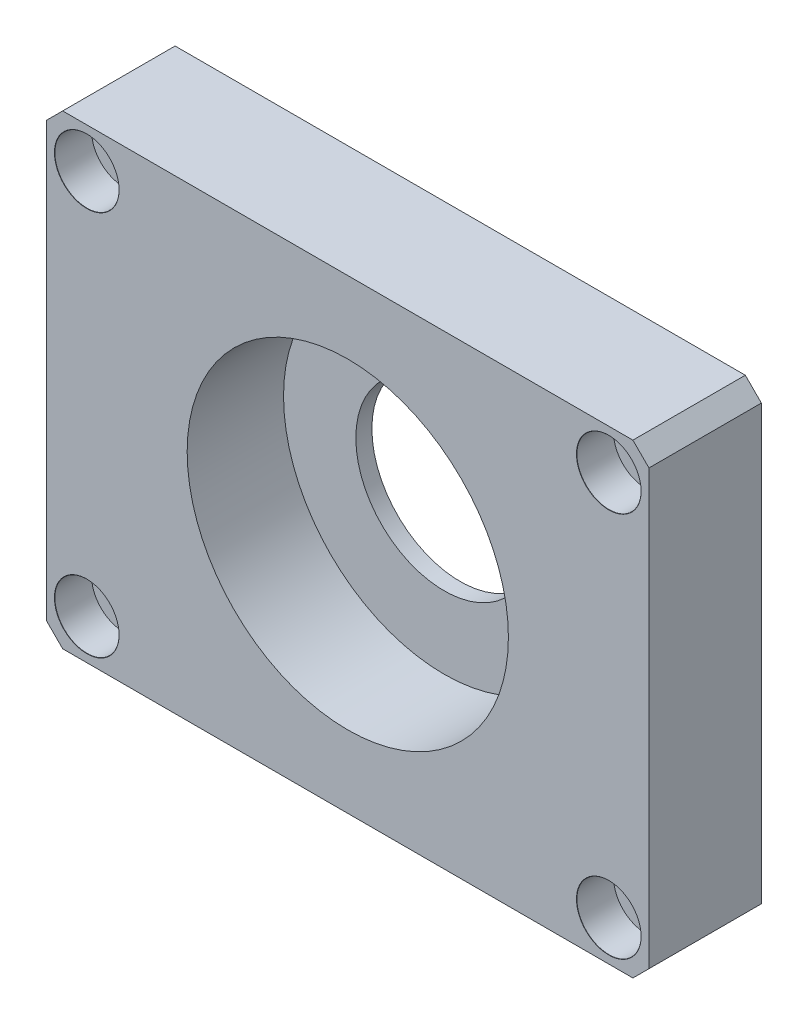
ISO-10303-21;
HEADER;
FILE_DESCRIPTION(('STEP AP214'),'2;1');
FILE_NAME('part.step','',(''),(''),'','','');
FILE_SCHEMA(('AUTOMOTIVE_DESIGN { 1 0 10303 214 1 1 1 1 }'));
ENDSEC;
DATA;
#1=APPLICATION_CONTEXT('core data for automotive mechanical design processes');
#2=APPLICATION_PROTOCOL_DEFINITION('international standard','automotive_design',2000,#1);
#3=PRODUCT_CONTEXT('',#1,'mechanical');
#4=PRODUCT('Part','Part','',(#3));
#5=PRODUCT_RELATED_PRODUCT_CATEGORY('part','',(#4));
#6=PRODUCT_DEFINITION_FORMATION('','',#4);
#7=PRODUCT_DEFINITION_CONTEXT('part definition',#1,'design');
#8=PRODUCT_DEFINITION('design','',#6,#7);
#9=PRODUCT_DEFINITION_SHAPE('','',#8);
#10=(LENGTH_UNIT() NAMED_UNIT(*) SI_UNIT(.MILLI.,.METRE.));
#11=(NAMED_UNIT(*) PLANE_ANGLE_UNIT() SI_UNIT($,.RADIAN.));
#12=(NAMED_UNIT(*) SI_UNIT($,.STERADIAN.) SOLID_ANGLE_UNIT());
#13=UNCERTAINTY_MEASURE_WITH_UNIT(LENGTH_MEASURE(1.E-05),#10,'distance_accuracy_value','');
#14=(GEOMETRIC_REPRESENTATION_CONTEXT(3) GLOBAL_UNCERTAINTY_ASSIGNED_CONTEXT((#13)) GLOBAL_UNIT_ASSIGNED_CONTEXT((#10,
#11,#12)) REPRESENTATION_CONTEXT('',''));
#15=CARTESIAN_POINT('',(0.,0.,0.));
#16=DIRECTION('',(0.,0.,1.));
#17=DIRECTION('',(1.,0.,0.));
#18=AXIS2_PLACEMENT_3D('',#15,#16,#17);
#19=CARTESIAN_POINT('',(-58.,3.,14.));
#20=DIRECTION('',(0.,0.,1.));
#21=DIRECTION('',(1.,0.,0.));
#22=AXIS2_PLACEMENT_3D('',#19,#20,#21);
#23=CYLINDRICAL_SURFACE('',#22,2.25);
#24=CARTESIAN_POINT('',(-58.,3.,9.375));
#25=DIRECTION('',(0.,0.,1.));
#26=DIRECTION('',(1.,0.,0.));
#27=AXIS2_PLACEMENT_3D('',#24,#25,#26);
#28=CIRCLE('',#27,2.25);
#29=CARTESIAN_POINT('',(-55.75,3.,9.375));
#30=VERTEX_POINT('',#29);
#31=EDGE_CURVE('E221',#30,#30,#28,.T.);
#32=ORIENTED_EDGE('',*,*,#31,.T.);
#33=EDGE_LOOP('',(#32));
#34=FACE_BOUND('',#33,.T.);
#35=CARTESIAN_POINT('',(-58.,3.,2.));
#36=DIRECTION('',(0.,0.,-1.));
#37=DIRECTION('',(-1.,0.,0.));
#38=AXIS2_PLACEMENT_3D('',#35,#36,#37);
#39=CIRCLE('',#38,2.25);
#40=CARTESIAN_POINT('',(-60.25,3.,2.));
#41=VERTEX_POINT('',#40);
#42=EDGE_CURVE('E134',#41,#41,#39,.F.);
#43=ORIENTED_EDGE('',*,*,#42,.F.);
#44=EDGE_LOOP('',(#43));
#45=FACE_BOUND('',#44,.T.);
#46=ADVANCED_FACE('F16',(#34,#45),#23,.F.);
#47=CARTESIAN_POINT('',(6.99999999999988,3.,14.));
#48=DIRECTION('',(0.,0.,1.));
#49=DIRECTION('',(1.,0.,0.));
#50=AXIS2_PLACEMENT_3D('',#47,#48,#49);
#51=CYLINDRICAL_SURFACE('',#50,2.25);
#52=CARTESIAN_POINT('',(6.99999999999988,3.,9.375));
#53=DIRECTION('',(0.,0.,1.));
#54=DIRECTION('',(1.,0.,0.));
#55=AXIS2_PLACEMENT_3D('',#52,#53,#54);
#56=CIRCLE('',#55,2.25);
#57=CARTESIAN_POINT('',(9.24999999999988,3.,9.375));
#58=VERTEX_POINT('',#57);
#59=EDGE_CURVE('E206',#58,#58,#56,.T.);
#60=ORIENTED_EDGE('',*,*,#59,.T.);
#61=EDGE_LOOP('',(#60));
#62=FACE_BOUND('',#61,.T.);
#63=CARTESIAN_POINT('',(6.99999999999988,3.,2.));
#64=DIRECTION('',(0.,0.,-1.));
#65=DIRECTION('',(-1.,0.,0.));
#66=AXIS2_PLACEMENT_3D('',#63,#64,#65);
#67=CIRCLE('',#66,2.25);
#68=CARTESIAN_POINT('',(4.74999999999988,3.,2.));
#69=VERTEX_POINT('',#68);
#70=EDGE_CURVE('E129',#69,#69,#67,.F.);
#71=ORIENTED_EDGE('',*,*,#70,.F.);
#72=EDGE_LOOP('',(#71));
#73=FACE_BOUND('',#72,.T.);
#74=ADVANCED_FACE('F317',(#62,#73),#51,.F.);
#75=CARTESIAN_POINT('',(6.99999999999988,-45.,14.));
#76=DIRECTION('',(0.,0.,1.));
#77=DIRECTION('',(1.,0.,0.));
#78=AXIS2_PLACEMENT_3D('',#75,#76,#77);
#79=CYLINDRICAL_SURFACE('',#78,2.25);
#80=CARTESIAN_POINT('',(6.99999999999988,-45.,9.375));
#81=DIRECTION('',(0.,0.,1.));
#82=DIRECTION('',(1.,0.,0.));
#83=AXIS2_PLACEMENT_3D('',#80,#81,#82);
#84=CIRCLE('',#83,2.25);
#85=CARTESIAN_POINT('',(9.24999999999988,-45.,9.375));
#86=VERTEX_POINT('',#85);
#87=EDGE_CURVE('E191',#86,#86,#84,.T.);
#88=ORIENTED_EDGE('',*,*,#87,.T.);
#89=EDGE_LOOP('',(#88));
#90=FACE_BOUND('',#89,.T.);
#91=CARTESIAN_POINT('',(6.99999999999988,-45.,2.));
#92=DIRECTION('',(0.,0.,-1.));
#93=DIRECTION('',(-1.,0.,0.));
#94=AXIS2_PLACEMENT_3D('',#91,#92,#93);
#95=CIRCLE('',#94,2.25);
#96=CARTESIAN_POINT('',(4.74999999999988,-45.,2.));
#97=VERTEX_POINT('',#96);
#98=EDGE_CURVE('E124',#97,#97,#95,.F.);
#99=ORIENTED_EDGE('',*,*,#98,.F.);
#100=EDGE_LOOP('',(#99));
#101=FACE_BOUND('',#100,.T.);
#102=ADVANCED_FACE('F324',(#90,#101),#79,.F.);
#103=CARTESIAN_POINT('',(-58.,-45.,14.));
#104=DIRECTION('',(0.,0.,1.));
#105=DIRECTION('',(1.,0.,0.));
#106=AXIS2_PLACEMENT_3D('',#103,#104,#105);
#107=CYLINDRICAL_SURFACE('',#106,2.25);
#108=CARTESIAN_POINT('',(-58.,-45.,9.375));
#109=DIRECTION('',(0.,0.,1.));
#110=DIRECTION('',(1.,0.,0.));
#111=AXIS2_PLACEMENT_3D('',#108,#109,#110);
#112=CIRCLE('',#111,2.25);
#113=CARTESIAN_POINT('',(-55.75,-45.,9.375));
#114=VERTEX_POINT('',#113);
#115=EDGE_CURVE('E170',#114,#114,#112,.T.);
#116=ORIENTED_EDGE('',*,*,#115,.T.);
#117=EDGE_LOOP('',(#116));
#118=FACE_BOUND('',#117,.T.);
#119=CARTESIAN_POINT('',(-58.,-45.,2.));
#120=DIRECTION('',(0.,0.,-1.));
#121=DIRECTION('',(-1.,0.,0.));
#122=AXIS2_PLACEMENT_3D('',#119,#120,#121);
#123=CIRCLE('',#122,2.25);
#124=CARTESIAN_POINT('',(-60.25,-45.,2.));
#125=VERTEX_POINT('',#124);
#126=EDGE_CURVE('E119',#125,#125,#123,.F.);
#127=ORIENTED_EDGE('',*,*,#126,.F.);
#128=EDGE_LOOP('',(#127));
#129=FACE_BOUND('',#128,.T.);
#130=ADVANCED_FACE('F359',(#118,#129),#107,.F.);
#131=CARTESIAN_POINT('',(-63.,-50.,14.));
#132=DIRECTION('',(1.,0.,0.));
#133=DIRECTION('',(0.,0.,-1.));
#134=AXIS2_PLACEMENT_3D('',#131,#132,#133);
#135=PLANE('',#134);
#136=DIRECTION('',(0.,-1.,0.));
#137=VECTOR('',#136,1.);
#138=CARTESIAN_POINT('',(-63.,-50.,14.));
#139=LINE('',#138,#137);
#140=CARTESIAN_POINT('',(-63.,6.,14.));
#141=VERTEX_POINT('',#140);
#142=CARTESIAN_POINT('',(-63.,-48.,14.));
#143=VERTEX_POINT('',#142);
#144=EDGE_CURVE('E110',#141,#143,#139,.T.);
#145=ORIENTED_EDGE('',*,*,#144,.F.);
#146=DIRECTION('',(0.,0.,-1.));
#147=VECTOR('',#146,1.);
#148=CARTESIAN_POINT('',(-63.,6.,14.));
#149=LINE('',#148,#147);
#150=CARTESIAN_POINT('',(-63.,6.,0.));
#151=VERTEX_POINT('',#150);
#152=EDGE_CURVE('E11',#141,#151,#149,.T.);
#153=ORIENTED_EDGE('',*,*,#152,.T.);
#154=DIRECTION('',(0.,-1.,0.));
#155=VECTOR('',#154,1.);
#156=CARTESIAN_POINT('',(-63.,-50.,0.));
#157=LINE('',#156,#155);
#158=CARTESIAN_POINT('',(-63.,-48.,0.));
#159=VERTEX_POINT('',#158);
#160=EDGE_CURVE('E162',#151,#159,#157,.T.);
#161=ORIENTED_EDGE('',*,*,#160,.T.);
#162=DIRECTION('',(0.,0.,1.));
#163=VECTOR('',#162,1.);
#164=CARTESIAN_POINT('',(-63.,-48.,14.));
#165=LINE('',#164,#163);
#166=EDGE_CURVE('E24',#159,#143,#165,.T.);
#167=ORIENTED_EDGE('',*,*,#166,.T.);
#168=EDGE_LOOP('',(#145,#153,#161,#167));
#169=FACE_BOUND('',#168,.T.);
#170=ADVANCED_FACE('F160',(#169),#135,.F.);
#171=CARTESIAN_POINT('',(-63.,-50.,14.));
#172=DIRECTION('',(0.,1.,0.));
#173=DIRECTION('',(0.,0.,1.));
#174=AXIS2_PLACEMENT_3D('',#171,#172,#173);
#175=PLANE('',#174);
#176=DIRECTION('',(1.,0.,0.));
#177=VECTOR('',#176,1.);
#178=CARTESIAN_POINT('',(-63.,-50.,0.));
#179=LINE('',#178,#177);
#180=CARTESIAN_POINT('',(-61.,-50.,0.));
#181=VERTEX_POINT('',#180);
#182=CARTESIAN_POINT('',(9.99999999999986,-50.,0.));
#183=VERTEX_POINT('',#182);
#184=EDGE_CURVE('E115',#181,#183,#179,.T.);
#185=ORIENTED_EDGE('',*,*,#184,.T.);
#186=DIRECTION('',(0.,0.,1.));
#187=VECTOR('',#186,1.);
#188=CARTESIAN_POINT('',(9.99999999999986,-50.,14.));
#189=LINE('',#188,#187);
#190=CARTESIAN_POINT('',(9.99999999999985,-50.,14.));
#191=VERTEX_POINT('',#190);
#192=EDGE_CURVE('E31',#183,#191,#189,.T.);
#193=ORIENTED_EDGE('',*,*,#192,.T.);
#194=DIRECTION('',(1.,0.,0.));
#195=VECTOR('',#194,1.);
#196=CARTESIAN_POINT('',(-63.,-50.,14.));
#197=LINE('',#196,#195);
#198=CARTESIAN_POINT('',(-61.,-50.,14.));
#199=VERTEX_POINT('',#198);
#200=EDGE_CURVE('E113',#199,#191,#197,.T.);
#201=ORIENTED_EDGE('',*,*,#200,.F.);
#202=DIRECTION('',(0.,0.,-1.));
#203=VECTOR('',#202,1.);
#204=CARTESIAN_POINT('',(-61.,-50.,14.));
#205=LINE('',#204,#203);
#206=EDGE_CURVE('E153',#199,#181,#205,.T.);
#207=ORIENTED_EDGE('',*,*,#206,.T.);
#208=EDGE_LOOP('',(#185,#193,#201,#207));
#209=FACE_BOUND('',#208,.T.);
#210=ADVANCED_FACE('F169',(#209),#175,.F.);
#211=CARTESIAN_POINT('',(11.9999999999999,-50.,14.));
#212=DIRECTION('',(-1.,0.,0.));
#213=DIRECTION('',(0.,-1.,0.));
#214=AXIS2_PLACEMENT_3D('',#211,#212,#213);
#215=PLANE('',#214);
#216=DIRECTION('',(0.,1.,0.));
#217=VECTOR('',#216,1.);
#218=CARTESIAN_POINT('',(11.9999999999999,-50.,0.));
#219=LINE('',#218,#217);
#220=CARTESIAN_POINT('',(11.9999999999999,-48.,0.));
#221=VERTEX_POINT('',#220);
#222=CARTESIAN_POINT('',(12.,6.,0.));
#223=VERTEX_POINT('',#222);
#224=EDGE_CURVE('E111',#221,#223,#219,.T.);
#225=ORIENTED_EDGE('',*,*,#224,.T.);
#226=DIRECTION('',(0.,0.,1.));
#227=VECTOR('',#226,1.);
#228=CARTESIAN_POINT('',(12.,6.,14.));
#229=LINE('',#228,#227);
#230=CARTESIAN_POINT('',(12.,6.,14.));
#231=VERTEX_POINT('',#230);
#232=EDGE_CURVE('E88',#223,#231,#229,.T.);
#233=ORIENTED_EDGE('',*,*,#232,.T.);
#234=DIRECTION('',(0.,1.,0.));
#235=VECTOR('',#234,1.);
#236=CARTESIAN_POINT('',(11.9999999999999,-50.,14.));
#237=LINE('',#236,#235);
#238=CARTESIAN_POINT('',(11.9999999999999,-48.,14.));
#239=VERTEX_POINT('',#238);
#240=EDGE_CURVE('E174',#239,#231,#237,.T.);
#241=ORIENTED_EDGE('',*,*,#240,.F.);
#242=DIRECTION('',(0.,0.,-1.));
#243=VECTOR('',#242,1.);
#244=CARTESIAN_POINT('',(11.9999999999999,-48.,14.));
#245=LINE('',#244,#243);
#246=EDGE_CURVE('E93',#239,#221,#245,.T.);
#247=ORIENTED_EDGE('',*,*,#246,.T.);
#248=EDGE_LOOP('',(#225,#233,#241,#247));
#249=FACE_BOUND('',#248,.T.);
#250=ADVANCED_FACE('F518',(#249),#215,.F.);
#251=CARTESIAN_POINT('',(-63.,8.,14.));
#252=DIRECTION('',(0.,-1.,0.));
#253=DIRECTION('',(0.,0.,-1.));
#254=AXIS2_PLACEMENT_3D('',#251,#252,#253);
#255=PLANE('',#254);
#256=DIRECTION('',(-1.,0.,0.));
#257=VECTOR('',#256,1.);
#258=CARTESIAN_POINT('',(-63.,8.,14.));
#259=LINE('',#258,#257);
#260=CARTESIAN_POINT('',(9.99999999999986,8.,14.));
#261=VERTEX_POINT('',#260);
#262=CARTESIAN_POINT('',(-61.,8.,14.));
#263=VERTEX_POINT('',#262);
#264=EDGE_CURVE('E103',#261,#263,#259,.T.);
#265=ORIENTED_EDGE('',*,*,#264,.F.);
#266=DIRECTION('',(0.,0.,-1.));
#267=VECTOR('',#266,1.);
#268=CARTESIAN_POINT('',(9.99999999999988,8.,14.));
#269=LINE('',#268,#267);
#270=CARTESIAN_POINT('',(9.99999999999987,8.,0.));
#271=VERTEX_POINT('',#270);
#272=EDGE_CURVE('E87',#261,#271,#269,.T.);
#273=ORIENTED_EDGE('',*,*,#272,.T.);
#274=DIRECTION('',(-1.,0.,0.));
#275=VECTOR('',#274,1.);
#276=CARTESIAN_POINT('',(-63.,8.,0.));
#277=LINE('',#276,#275);
#278=CARTESIAN_POINT('',(-61.,8.,0.));
#279=VERTEX_POINT('',#278);
#280=EDGE_CURVE('E100',#271,#279,#277,.T.);
#281=ORIENTED_EDGE('',*,*,#280,.T.);
#282=DIRECTION('',(0.,0.,1.));
#283=VECTOR('',#282,1.);
#284=CARTESIAN_POINT('',(-61.,8.,14.));
#285=LINE('',#284,#283);
#286=EDGE_CURVE('E105',#279,#263,#285,.T.);
#287=ORIENTED_EDGE('',*,*,#286,.T.);
#288=EDGE_LOOP('',(#265,#273,#281,#287));
#289=FACE_BOUND('',#288,.T.);
#290=ADVANCED_FACE('F99',(#289),#255,.F.);
#291=CARTESIAN_POINT('',(0.,0.,14.));
#292=DIRECTION('',(0.,0.,-1.));
#293=DIRECTION('',(-1.,0.,0.));
#294=AXIS2_PLACEMENT_3D('',#291,#292,#293);
#295=PLANE('',#294);
#296=CARTESIAN_POINT('',(-25.5,-21.,14.));
#297=DIRECTION('',(0.,0.,1.));
#298=DIRECTION('',(1.,0.,0.));
#299=AXIS2_PLACEMENT_3D('',#296,#297,#298);
#300=CIRCLE('',#299,20.);
#301=CARTESIAN_POINT('',(-5.5,-21.,14.));
#302=VERTEX_POINT('',#301);
#303=EDGE_CURVE('E253',#302,#302,#300,.T.);
#304=ORIENTED_EDGE('',*,*,#303,.F.);
#305=EDGE_LOOP('',(#304));
#306=FACE_BOUND('',#305,.T.);
#307=CARTESIAN_POINT('',(-58.,3.,14.));
#308=DIRECTION('',(0.,0.,1.));
#309=DIRECTION('',(1.,0.,0.));
#310=AXIS2_PLACEMENT_3D('',#307,#308,#309);
#311=CIRCLE('',#310,4.025);
#312=CARTESIAN_POINT('',(-53.975,3.,14.));
#313=VERTEX_POINT('',#312);
#314=EDGE_CURVE('E122',#313,#313,#311,.T.);
#315=ORIENTED_EDGE('',*,*,#314,.F.);
#316=EDGE_LOOP('',(#315));
#317=FACE_BOUND('',#316,.T.);
#318=CARTESIAN_POINT('',(6.99999999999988,3.,14.));
#319=DIRECTION('',(0.,0.,1.));
#320=DIRECTION('',(1.,0.,0.));
#321=AXIS2_PLACEMENT_3D('',#318,#319,#320);
#322=CIRCLE('',#321,4.025);
#323=CARTESIAN_POINT('',(11.0249999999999,3.,14.));
#324=VERTEX_POINT('',#323);
#325=EDGE_CURVE('E218',#324,#324,#322,.T.);
#326=ORIENTED_EDGE('',*,*,#325,.F.);
#327=EDGE_LOOP('',(#326));
#328=FACE_BOUND('',#327,.T.);
#329=CARTESIAN_POINT('',(6.99999999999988,-45.,14.));
#330=DIRECTION('',(0.,0.,1.));
#331=DIRECTION('',(1.,0.,0.));
#332=AXIS2_PLACEMENT_3D('',#329,#330,#331);
#333=CIRCLE('',#332,4.025);
#334=CARTESIAN_POINT('',(11.0249999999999,-45.,14.));
#335=VERTEX_POINT('',#334);
#336=EDGE_CURVE('E203',#335,#335,#333,.T.);
#337=ORIENTED_EDGE('',*,*,#336,.F.);
#338=EDGE_LOOP('',(#337));
#339=FACE_BOUND('',#338,.T.);
#340=CARTESIAN_POINT('',(-58.,-45.,14.));
#341=DIRECTION('',(0.,0.,1.));
#342=DIRECTION('',(1.,0.,0.));
#343=AXIS2_PLACEMENT_3D('',#340,#341,#342);
#344=CIRCLE('',#343,4.025);
#345=CARTESIAN_POINT('',(-53.975,-45.,14.));
#346=VERTEX_POINT('',#345);
#347=EDGE_CURVE('E188',#346,#346,#344,.T.);
#348=ORIENTED_EDGE('',*,*,#347,.F.);
#349=EDGE_LOOP('',(#348));
#350=FACE_BOUND('',#349,.T.);
#351=ORIENTED_EDGE('',*,*,#240,.T.);
#352=DIRECTION('',(0.707106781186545,-0.70710678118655,0.));
#353=VECTOR('',#352,1.);
#354=CARTESIAN_POINT('',(9.99999999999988,8.,14.));
#355=LINE('',#354,#353);
#356=EDGE_CURVE('E151',#231,#261,#355,.F.);
#357=ORIENTED_EDGE('',*,*,#356,.T.);
#358=ORIENTED_EDGE('',*,*,#264,.T.);
#359=DIRECTION('',(0.70710678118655,0.707106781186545,0.));
#360=VECTOR('',#359,1.);
#361=CARTESIAN_POINT('',(-63.,6.,14.));
#362=LINE('',#361,#360);
#363=EDGE_CURVE('E147',#263,#141,#362,.F.);
#364=ORIENTED_EDGE('',*,*,#363,.T.);
#365=ORIENTED_EDGE('',*,*,#144,.T.);
#366=DIRECTION('',(-0.707106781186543,0.707106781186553,0.));
#367=VECTOR('',#366,1.);
#368=CARTESIAN_POINT('',(-61.,-50.,14.));
#369=LINE('',#368,#367);
#370=EDGE_CURVE('E38',#143,#199,#369,.F.);
#371=ORIENTED_EDGE('',*,*,#370,.T.);
#372=ORIENTED_EDGE('',*,*,#200,.T.);
#373=DIRECTION('',(-0.707106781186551,-0.707106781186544,0.));
#374=VECTOR('',#373,1.);
#375=CARTESIAN_POINT('',(11.9999999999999,-48.,14.));
#376=LINE('',#375,#374);
#377=EDGE_CURVE('E149',#191,#239,#376,.F.);
#378=ORIENTED_EDGE('',*,*,#377,.T.);
#379=EDGE_LOOP('',(#351,#357,#358,#364,#365,#371,#372,#378));
#380=FACE_BOUND('',#379,.T.);
#381=ADVANCED_FACE('F165',(#306,#317,#328,#339,#350,#380),#295,.F.);
#382=CARTESIAN_POINT('',(0.,0.,0.));
#383=DIRECTION('',(0.,0.,-1.));
#384=DIRECTION('',(-1.,0.,0.));
#385=AXIS2_PLACEMENT_3D('',#382,#383,#384);
#386=PLANE('',#385);
#387=CARTESIAN_POINT('',(-25.5,-21.,0.));
#388=DIRECTION('',(0.,0.,1.));
#389=DIRECTION('',(1.,0.,0.));
#390=AXIS2_PLACEMENT_3D('',#387,#388,#389);
#391=CIRCLE('',#390,11.);
#392=CARTESIAN_POINT('',(-14.5,-21.,0.));
#393=VERTEX_POINT('',#392);
#394=EDGE_CURVE('E256',#393,#393,#391,.T.);
#395=ORIENTED_EDGE('',*,*,#394,.T.);
#396=EDGE_LOOP('',(#395));
#397=FACE_BOUND('',#396,.T.);
#398=CARTESIAN_POINT('',(-58.,3.,0.));
#399=DIRECTION('',(0.,0.,-1.));
#400=DIRECTION('',(-1.,0.,0.));
#401=AXIS2_PLACEMENT_3D('',#398,#399,#400);
#402=CIRCLE('',#401,4.);
#403=CARTESIAN_POINT('',(-62.,3.,0.));
#404=VERTEX_POINT('',#403);
#405=EDGE_CURVE('E247',#404,#404,#402,.T.);
#406=ORIENTED_EDGE('',*,*,#405,.F.);
#407=EDGE_LOOP('',(#406));
#408=FACE_BOUND('',#407,.T.);
#409=CARTESIAN_POINT('',(6.99999999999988,3.,0.));
#410=DIRECTION('',(0.,0.,-1.));
#411=DIRECTION('',(-1.,0.,0.));
#412=AXIS2_PLACEMENT_3D('',#409,#410,#411);
#413=CIRCLE('',#412,4.);
#414=CARTESIAN_POINT('',(2.99999999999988,3.,0.));
#415=VERTEX_POINT('',#414);
#416=EDGE_CURVE('E137',#415,#415,#413,.T.);
#417=ORIENTED_EDGE('',*,*,#416,.F.);
#418=EDGE_LOOP('',(#417));
#419=FACE_BOUND('',#418,.T.);
#420=CARTESIAN_POINT('',(6.99999999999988,-45.,0.));
#421=DIRECTION('',(0.,0.,-1.));
#422=DIRECTION('',(-1.,0.,0.));
#423=AXIS2_PLACEMENT_3D('',#420,#421,#422);
#424=CIRCLE('',#423,4.);
#425=CARTESIAN_POINT('',(2.99999999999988,-45.,0.));
#426=VERTEX_POINT('',#425);
#427=EDGE_CURVE('E132',#426,#426,#424,.T.);
#428=ORIENTED_EDGE('',*,*,#427,.F.);
#429=EDGE_LOOP('',(#428));
#430=FACE_BOUND('',#429,.T.);
#431=CARTESIAN_POINT('',(-58.,-45.,0.));
#432=DIRECTION('',(0.,0.,-1.));
#433=DIRECTION('',(-1.,0.,0.));
#434=AXIS2_PLACEMENT_3D('',#431,#432,#433);
#435=CIRCLE('',#434,4.);
#436=CARTESIAN_POINT('',(-62.,-45.,0.));
#437=VERTEX_POINT('',#436);
#438=EDGE_CURVE('E127',#437,#437,#435,.T.);
#439=ORIENTED_EDGE('',*,*,#438,.F.);
#440=EDGE_LOOP('',(#439));
#441=FACE_BOUND('',#440,.T.);
#442=ORIENTED_EDGE('',*,*,#280,.F.);
#443=DIRECTION('',(-0.707106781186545,0.70710678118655,0.));
#444=VECTOR('',#443,1.);
#445=CARTESIAN_POINT('',(9.,9.,0.));
#446=LINE('',#445,#444);
#447=EDGE_CURVE('E83',#271,#223,#446,.F.);
#448=ORIENTED_EDGE('',*,*,#447,.T.);
#449=ORIENTED_EDGE('',*,*,#224,.F.);
#450=DIRECTION('',(0.707106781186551,0.707106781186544,0.));
#451=VECTOR('',#450,1.);
#452=CARTESIAN_POINT('',(30.,-30.,0.));
#453=LINE('',#452,#451);
#454=EDGE_CURVE('E94',#221,#183,#453,.F.);
#455=ORIENTED_EDGE('',*,*,#454,.T.);
#456=ORIENTED_EDGE('',*,*,#184,.F.);
#457=DIRECTION('',(0.707106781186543,-0.707106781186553,0.));
#458=VECTOR('',#457,1.);
#459=CARTESIAN_POINT('',(-55.5,-55.5,0.));
#460=LINE('',#459,#458);
#461=EDGE_CURVE('E104',#181,#159,#460,.F.);
#462=ORIENTED_EDGE('',*,*,#461,.T.);
#463=ORIENTED_EDGE('',*,*,#160,.F.);
#464=DIRECTION('',(-0.70710678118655,-0.707106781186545,0.));
#465=VECTOR('',#464,1.);
#466=CARTESIAN_POINT('',(-34.5,34.5,0.));
#467=LINE('',#466,#465);
#468=EDGE_CURVE('E109',#151,#279,#467,.F.);
#469=ORIENTED_EDGE('',*,*,#468,.T.);
#470=EDGE_LOOP('',(#442,#448,#449,#455,#456,#462,#463,#469));
#471=FACE_BOUND('',#470,.T.);
#472=ADVANCED_FACE('F107',(#397,#408,#419,#430,#441,#471),#386,.T.);
#473=CARTESIAN_POINT('',(-58.,-45.,9.4));
#474=DIRECTION('',(0.,0.,1.));
#475=DIRECTION('',(1.,0.,0.));
#476=AXIS2_PLACEMENT_3D('',#473,#474,#475);
#477=CONICAL_SURFACE('',#476,2.275,0.785398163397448);
#478=ORIENTED_EDGE('',*,*,#115,.F.);
#479=EDGE_LOOP('',(#478));
#480=FACE_BOUND('',#479,.T.);
#481=CARTESIAN_POINT('',(-58.,-45.,9.4));
#482=DIRECTION('',(0.,0.,1.));
#483=DIRECTION('',(1.,0.,0.));
#484=AXIS2_PLACEMENT_3D('',#481,#482,#483);
#485=CIRCLE('',#484,2.275);
#486=CARTESIAN_POINT('',(-55.725,-45.,9.4));
#487=VERTEX_POINT('',#486);
#488=EDGE_CURVE('E179',#487,#487,#485,.T.);
#489=ORIENTED_EDGE('',*,*,#488,.T.);
#490=EDGE_LOOP('',(#489));
#491=FACE_BOUND('',#490,.T.);
#492=ADVANCED_FACE('F485',(#480,#491),#477,.F.);
#493=CARTESIAN_POINT('',(-55.725,-45.,9.4));
#494=DIRECTION('',(0.,0.,-1.));
#495=DIRECTION('',(-1.,0.,0.));
#496=AXIS2_PLACEMENT_3D('',#493,#494,#495);
#497=PLANE('',#496);
#498=ORIENTED_EDGE('',*,*,#488,.F.);
#499=EDGE_LOOP('',(#498));
#500=FACE_BOUND('',#499,.T.);
#501=CARTESIAN_POINT('',(-58.,-45.,9.4));
#502=DIRECTION('',(0.,0.,1.));
#503=DIRECTION('',(1.,0.,0.));
#504=AXIS2_PLACEMENT_3D('',#501,#502,#503);
#505=CIRCLE('',#504,4.);
#506=CARTESIAN_POINT('',(-54.,-45.,9.4));
#507=VERTEX_POINT('',#506);
#508=EDGE_CURVE('E182',#507,#507,#505,.T.);
#509=ORIENTED_EDGE('',*,*,#508,.T.);
#510=EDGE_LOOP('',(#509));
#511=FACE_BOUND('',#510,.T.);
#512=ADVANCED_FACE('F311',(#500,#511),#497,.F.);
#513=CARTESIAN_POINT('',(-58.,-45.,14.));
#514=DIRECTION('',(0.,0.,1.));
#515=DIRECTION('',(1.,0.,0.));
#516=AXIS2_PLACEMENT_3D('',#513,#514,#515);
#517=CYLINDRICAL_SURFACE('',#516,4.);
#518=ORIENTED_EDGE('',*,*,#508,.F.);
#519=EDGE_LOOP('',(#518));
#520=FACE_BOUND('',#519,.T.);
#521=CARTESIAN_POINT('',(-58.,-45.,13.975));
#522=DIRECTION('',(0.,0.,1.));
#523=DIRECTION('',(1.,0.,0.));
#524=AXIS2_PLACEMENT_3D('',#521,#522,#523);
#525=CIRCLE('',#524,4.);
#526=CARTESIAN_POINT('',(-54.,-45.,13.975));
#527=VERTEX_POINT('',#526);
#528=EDGE_CURVE('E185',#527,#527,#525,.T.);
#529=ORIENTED_EDGE('',*,*,#528,.T.);
#530=EDGE_LOOP('',(#529));
#531=FACE_BOUND('',#530,.T.);
#532=ADVANCED_FACE('F299',(#520,#531),#517,.F.);
#533=CARTESIAN_POINT('',(-58.,-45.,14.));
#534=DIRECTION('',(0.,0.,1.));
#535=DIRECTION('',(1.,0.,0.));
#536=AXIS2_PLACEMENT_3D('',#533,#534,#535);
#537=CONICAL_SURFACE('',#536,4.025,0.785398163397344);
#538=ORIENTED_EDGE('',*,*,#528,.F.);
#539=EDGE_LOOP('',(#538));
#540=FACE_BOUND('',#539,.T.);
#541=ORIENTED_EDGE('',*,*,#347,.T.);
#542=EDGE_LOOP('',(#541));
#543=FACE_BOUND('',#542,.T.);
#544=ADVANCED_FACE('F296',(#540,#543),#537,.F.);
#545=CARTESIAN_POINT('',(6.99999999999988,-45.,9.4));
#546=DIRECTION('',(0.,0.,1.));
#547=DIRECTION('',(1.,0.,0.));
#548=AXIS2_PLACEMENT_3D('',#545,#546,#547);
#549=CONICAL_SURFACE('',#548,2.275,0.785398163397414);
#550=ORIENTED_EDGE('',*,*,#87,.F.);
#551=EDGE_LOOP('',(#550));
#552=FACE_BOUND('',#551,.T.);
#553=CARTESIAN_POINT('',(6.99999999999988,-45.,9.4));
#554=DIRECTION('',(0.,0.,1.));
#555=DIRECTION('',(1.,0.,0.));
#556=AXIS2_PLACEMENT_3D('',#553,#554,#555);
#557=CIRCLE('',#556,2.275);
#558=CARTESIAN_POINT('',(9.27499999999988,-45.,9.4));
#559=VERTEX_POINT('',#558);
#560=EDGE_CURVE('E194',#559,#559,#557,.T.);
#561=ORIENTED_EDGE('',*,*,#560,.T.);
#562=EDGE_LOOP('',(#561));
#563=FACE_BOUND('',#562,.T.);
#564=ADVANCED_FACE('F298',(#552,#563),#549,.F.);
#565=CARTESIAN_POINT('',(9.27499999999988,-45.,9.4));
#566=DIRECTION('',(0.,0.,-1.));
#567=DIRECTION('',(-1.,0.,0.));
#568=AXIS2_PLACEMENT_3D('',#565,#566,#567);
#569=PLANE('',#568);
#570=ORIENTED_EDGE('',*,*,#560,.F.);
#571=EDGE_LOOP('',(#570));
#572=FACE_BOUND('',#571,.T.);
#573=CARTESIAN_POINT('',(6.99999999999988,-45.,9.4));
#574=DIRECTION('',(0.,0.,1.));
#575=DIRECTION('',(1.,0.,0.));
#576=AXIS2_PLACEMENT_3D('',#573,#574,#575);
#577=CIRCLE('',#576,4.);
#578=CARTESIAN_POINT('',(10.9999999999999,-45.,9.4));
#579=VERTEX_POINT('',#578);
#580=EDGE_CURVE('E197',#579,#579,#577,.T.);
#581=ORIENTED_EDGE('',*,*,#580,.T.);
#582=EDGE_LOOP('',(#581));
#583=FACE_BOUND('',#582,.T.);
#584=ADVANCED_FACE('F308',(#572,#583),#569,.F.);
#585=CARTESIAN_POINT('',(6.99999999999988,-45.,14.));
#586=DIRECTION('',(0.,0.,1.));
#587=DIRECTION('',(1.,0.,0.));
#588=AXIS2_PLACEMENT_3D('',#585,#586,#587);
#589=CYLINDRICAL_SURFACE('',#588,4.);
#590=ORIENTED_EDGE('',*,*,#580,.F.);
#591=EDGE_LOOP('',(#590));
#592=FACE_BOUND('',#591,.T.);
#593=CARTESIAN_POINT('',(6.99999999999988,-45.,13.975));
#594=DIRECTION('',(0.,0.,1.));
#595=DIRECTION('',(1.,0.,0.));
#596=AXIS2_PLACEMENT_3D('',#593,#594,#595);
#597=CIRCLE('',#596,4.);
#598=CARTESIAN_POINT('',(10.9999999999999,-45.,13.975));
#599=VERTEX_POINT('',#598);
#600=EDGE_CURVE('E200',#599,#599,#597,.T.);
#601=ORIENTED_EDGE('',*,*,#600,.T.);
#602=EDGE_LOOP('',(#601));
#603=FACE_BOUND('',#602,.T.);
#604=ADVANCED_FACE('F351',(#592,#603),#589,.F.);
#605=CARTESIAN_POINT('',(6.99999999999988,-45.,14.));
#606=DIRECTION('',(0.,0.,1.));
#607=DIRECTION('',(1.,0.,0.));
#608=AXIS2_PLACEMENT_3D('',#605,#606,#607);
#609=CONICAL_SURFACE('',#608,4.025,0.785398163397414);
#610=ORIENTED_EDGE('',*,*,#600,.F.);
#611=EDGE_LOOP('',(#610));
#612=FACE_BOUND('',#611,.T.);
#613=ORIENTED_EDGE('',*,*,#336,.T.);
#614=EDGE_LOOP('',(#613));
#615=FACE_BOUND('',#614,.T.);
#616=ADVANCED_FACE('F346',(#612,#615),#609,.F.);
#617=CARTESIAN_POINT('',(6.99999999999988,3.,9.4));
#618=DIRECTION('',(0.,0.,1.));
#619=DIRECTION('',(1.,0.,0.));
#620=AXIS2_PLACEMENT_3D('',#617,#618,#619);
#621=CONICAL_SURFACE('',#620,2.275,0.785398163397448);
#622=ORIENTED_EDGE('',*,*,#59,.F.);
#623=EDGE_LOOP('',(#622));
#624=FACE_BOUND('',#623,.T.);
#625=CARTESIAN_POINT('',(6.99999999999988,3.,9.4));
#626=DIRECTION('',(0.,0.,1.));
#627=DIRECTION('',(1.,0.,0.));
#628=AXIS2_PLACEMENT_3D('',#625,#626,#627);
#629=CIRCLE('',#628,2.275);
#630=CARTESIAN_POINT('',(9.27499999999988,3.,9.4));
#631=VERTEX_POINT('',#630);
#632=EDGE_CURVE('E209',#631,#631,#629,.T.);
#633=ORIENTED_EDGE('',*,*,#632,.T.);
#634=EDGE_LOOP('',(#633));
#635=FACE_BOUND('',#634,.T.);
#636=ADVANCED_FACE('F343',(#624,#635),#621,.F.);
#637=CARTESIAN_POINT('',(9.27499999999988,3.,9.4));
#638=DIRECTION('',(0.,0.,-1.));
#639=DIRECTION('',(-1.,0.,0.));
#640=AXIS2_PLACEMENT_3D('',#637,#638,#639);
#641=PLANE('',#640);
#642=ORIENTED_EDGE('',*,*,#632,.F.);
#643=EDGE_LOOP('',(#642));
#644=FACE_BOUND('',#643,.T.);
#645=CARTESIAN_POINT('',(6.99999999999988,3.,9.4));
#646=DIRECTION('',(0.,0.,1.));
#647=DIRECTION('',(1.,0.,0.));
#648=AXIS2_PLACEMENT_3D('',#645,#646,#647);
#649=CIRCLE('',#648,4.);
#650=CARTESIAN_POINT('',(10.9999999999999,3.,9.4));
#651=VERTEX_POINT('',#650);
#652=EDGE_CURVE('E212',#651,#651,#649,.T.);
#653=ORIENTED_EDGE('',*,*,#652,.T.);
#654=EDGE_LOOP('',(#653));
#655=FACE_BOUND('',#654,.T.);
#656=ADVANCED_FACE('F339',(#644,#655),#641,.F.);
#657=CARTESIAN_POINT('',(6.99999999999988,3.,14.));
#658=DIRECTION('',(0.,0.,1.));
#659=DIRECTION('',(1.,0.,0.));
#660=AXIS2_PLACEMENT_3D('',#657,#658,#659);
#661=CYLINDRICAL_SURFACE('',#660,4.);
#662=ORIENTED_EDGE('',*,*,#652,.F.);
#663=EDGE_LOOP('',(#662));
#664=FACE_BOUND('',#663,.T.);
#665=CARTESIAN_POINT('',(6.99999999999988,3.,13.975));
#666=DIRECTION('',(0.,0.,1.));
#667=DIRECTION('',(1.,0.,0.));
#668=AXIS2_PLACEMENT_3D('',#665,#666,#667);
#669=CIRCLE('',#668,4.);
#670=CARTESIAN_POINT('',(10.9999999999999,3.,13.975));
#671=VERTEX_POINT('',#670);
#672=EDGE_CURVE('E215',#671,#671,#669,.T.);
#673=ORIENTED_EDGE('',*,*,#672,.T.);
#674=EDGE_LOOP('',(#673));
#675=FACE_BOUND('',#674,.T.);
#676=ADVANCED_FACE('F335',(#664,#675),#661,.F.);
#677=CARTESIAN_POINT('',(6.99999999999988,3.,14.));
#678=DIRECTION('',(0.,0.,1.));
#679=DIRECTION('',(1.,0.,0.));
#680=AXIS2_PLACEMENT_3D('',#677,#678,#679);
#681=CONICAL_SURFACE('',#680,4.025,0.785398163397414);
#682=ORIENTED_EDGE('',*,*,#672,.F.);
#683=EDGE_LOOP('',(#682));
#684=FACE_BOUND('',#683,.T.);
#685=ORIENTED_EDGE('',*,*,#325,.T.);
#686=EDGE_LOOP('',(#685));
#687=FACE_BOUND('',#686,.T.);
#688=ADVANCED_FACE('F332',(#684,#687),#681,.F.);
#689=CARTESIAN_POINT('',(-58.,3.,9.4));
#690=DIRECTION('',(0.,0.,1.));
#691=DIRECTION('',(1.,0.,0.));
#692=AXIS2_PLACEMENT_3D('',#689,#690,#691);
#693=CONICAL_SURFACE('',#692,2.275,0.785398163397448);
#694=ORIENTED_EDGE('',*,*,#31,.F.);
#695=EDGE_LOOP('',(#694));
#696=FACE_BOUND('',#695,.T.);
#697=CARTESIAN_POINT('',(-58.,3.,9.4));
#698=DIRECTION('',(0.,0.,1.));
#699=DIRECTION('',(1.,0.,0.));
#700=AXIS2_PLACEMENT_3D('',#697,#698,#699);
#701=CIRCLE('',#700,2.275);
#702=CARTESIAN_POINT('',(-55.725,3.,9.4));
#703=VERTEX_POINT('',#702);
#704=EDGE_CURVE('E224',#703,#703,#701,.T.);
#705=ORIENTED_EDGE('',*,*,#704,.T.);
#706=EDGE_LOOP('',(#705));
#707=FACE_BOUND('',#706,.T.);
#708=ADVANCED_FACE('F330',(#696,#707),#693,.F.);
#709=CARTESIAN_POINT('',(-55.725,3.,9.4));
#710=DIRECTION('',(0.,0.,-1.));
#711=DIRECTION('',(-1.,0.,0.));
#712=AXIS2_PLACEMENT_3D('',#709,#710,#711);
#713=PLANE('',#712);
#714=ORIENTED_EDGE('',*,*,#704,.F.);
#715=EDGE_LOOP('',(#714));
#716=FACE_BOUND('',#715,.T.);
#717=CARTESIAN_POINT('',(-58.,3.,9.4));
#718=DIRECTION('',(0.,0.,1.));
#719=DIRECTION('',(1.,0.,0.));
#720=AXIS2_PLACEMENT_3D('',#717,#718,#719);
#721=CIRCLE('',#720,4.);
#722=CARTESIAN_POINT('',(-54.,3.,9.4));
#723=VERTEX_POINT('',#722);
#724=EDGE_CURVE('E227',#723,#723,#721,.T.);
#725=ORIENTED_EDGE('',*,*,#724,.T.);
#726=EDGE_LOOP('',(#725));
#727=FACE_BOUND('',#726,.T.);
#728=ADVANCED_FACE('F401',(#716,#727),#713,.F.);
#729=CARTESIAN_POINT('',(-58.,3.,14.));
#730=DIRECTION('',(0.,0.,1.));
#731=DIRECTION('',(1.,0.,0.));
#732=AXIS2_PLACEMENT_3D('',#729,#730,#731);
#733=CYLINDRICAL_SURFACE('',#732,4.);
#734=ORIENTED_EDGE('',*,*,#724,.F.);
#735=EDGE_LOOP('',(#734));
#736=FACE_BOUND('',#735,.T.);
#737=CARTESIAN_POINT('',(-58.,3.,13.975));
#738=DIRECTION('',(0.,0.,1.));
#739=DIRECTION('',(1.,0.,0.));
#740=AXIS2_PLACEMENT_3D('',#737,#738,#739);
#741=CIRCLE('',#740,4.);
#742=CARTESIAN_POINT('',(-54.,3.,13.975));
#743=VERTEX_POINT('',#742);
#744=EDGE_CURVE('E230',#743,#743,#741,.T.);
#745=ORIENTED_EDGE('',*,*,#744,.T.);
#746=EDGE_LOOP('',(#745));
#747=FACE_BOUND('',#746,.T.);
#748=ADVANCED_FACE('F398',(#736,#747),#733,.F.);
#749=CARTESIAN_POINT('',(-58.,3.,14.));
#750=DIRECTION('',(0.,0.,1.));
#751=DIRECTION('',(1.,0.,0.));
#752=AXIS2_PLACEMENT_3D('',#749,#750,#751);
#753=CONICAL_SURFACE('',#752,4.025,0.785398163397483);
#754=ORIENTED_EDGE('',*,*,#744,.F.);
#755=EDGE_LOOP('',(#754));
#756=FACE_BOUND('',#755,.T.);
#757=ORIENTED_EDGE('',*,*,#314,.T.);
#758=EDGE_LOOP('',(#757));
#759=FACE_BOUND('',#758,.T.);
#760=ADVANCED_FACE('F393',(#756,#759),#753,.F.);
#761=CARTESIAN_POINT('',(-58.,-45.,2.));
#762=DIRECTION('',(0.,0.,-1.));
#763=DIRECTION('',(-1.,0.,0.));
#764=AXIS2_PLACEMENT_3D('',#761,#762,#763);
#765=PLANE('',#764);
#766=CARTESIAN_POINT('',(-58.,-45.,2.));
#767=DIRECTION('',(0.,0.,-1.));
#768=DIRECTION('',(-1.,0.,0.));
#769=AXIS2_PLACEMENT_3D('',#766,#767,#768);
#770=CIRCLE('',#769,4.);
#771=CARTESIAN_POINT('',(-62.,-45.,2.));
#772=VERTEX_POINT('',#771);
#773=EDGE_CURVE('E123',#772,#772,#770,.T.);
#774=ORIENTED_EDGE('',*,*,#773,.T.);
#775=EDGE_LOOP('',(#774));
#776=FACE_BOUND('',#775,.T.);
#777=ORIENTED_EDGE('',*,*,#126,.T.);
#778=EDGE_LOOP('',(#777));
#779=FACE_BOUND('',#778,.T.);
#780=ADVANCED_FACE('F385',(#776,#779),#765,.T.);
#781=CARTESIAN_POINT('',(-58.,-45.,2.));
#782=DIRECTION('',(0.,0.,-1.));
#783=DIRECTION('',(-1.,0.,0.));
#784=AXIS2_PLACEMENT_3D('',#781,#782,#783);
#785=CYLINDRICAL_SURFACE('',#784,4.);
#786=ORIENTED_EDGE('',*,*,#773,.F.);
#787=EDGE_LOOP('',(#786));
#788=FACE_BOUND('',#787,.T.);
#789=ORIENTED_EDGE('',*,*,#438,.T.);
#790=EDGE_LOOP('',(#789));
#791=FACE_BOUND('',#790,.T.);
#792=ADVANCED_FACE('F374',(#788,#791),#785,.F.);
#793=CARTESIAN_POINT('',(6.99999999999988,-45.,2.));
#794=DIRECTION('',(0.,0.,-1.));
#795=DIRECTION('',(-1.,0.,0.));
#796=AXIS2_PLACEMENT_3D('',#793,#794,#795);
#797=PLANE('',#796);
#798=CARTESIAN_POINT('',(6.99999999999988,-45.,2.));
#799=DIRECTION('',(0.,0.,-1.));
#800=DIRECTION('',(-1.,0.,0.));
#801=AXIS2_PLACEMENT_3D('',#798,#799,#800);
#802=CIRCLE('',#801,4.);
#803=CARTESIAN_POINT('',(2.99999999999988,-45.,2.));
#804=VERTEX_POINT('',#803);
#805=EDGE_CURVE('E128',#804,#804,#802,.T.);
#806=ORIENTED_EDGE('',*,*,#805,.T.);
#807=EDGE_LOOP('',(#806));
#808=FACE_BOUND('',#807,.T.);
#809=ORIENTED_EDGE('',*,*,#98,.T.);
#810=EDGE_LOOP('',(#809));
#811=FACE_BOUND('',#810,.T.);
#812=ADVANCED_FACE('F371',(#808,#811),#797,.T.);
#813=CARTESIAN_POINT('',(6.99999999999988,-45.,2.));
#814=DIRECTION('',(0.,0.,-1.));
#815=DIRECTION('',(-1.,0.,0.));
#816=AXIS2_PLACEMENT_3D('',#813,#814,#815);
#817=CYLINDRICAL_SURFACE('',#816,4.);
#818=ORIENTED_EDGE('',*,*,#805,.F.);
#819=EDGE_LOOP('',(#818));
#820=FACE_BOUND('',#819,.T.);
#821=ORIENTED_EDGE('',*,*,#427,.T.);
#822=EDGE_LOOP('',(#821));
#823=FACE_BOUND('',#822,.T.);
#824=ADVANCED_FACE('F373',(#820,#823),#817,.F.);
#825=CARTESIAN_POINT('',(6.99999999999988,3.,2.));
#826=DIRECTION('',(0.,0.,-1.));
#827=DIRECTION('',(-1.,0.,0.));
#828=AXIS2_PLACEMENT_3D('',#825,#826,#827);
#829=PLANE('',#828);
#830=CARTESIAN_POINT('',(6.99999999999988,3.,2.));
#831=DIRECTION('',(0.,0.,-1.));
#832=DIRECTION('',(-1.,0.,0.));
#833=AXIS2_PLACEMENT_3D('',#830,#831,#832);
#834=CIRCLE('',#833,4.);
#835=CARTESIAN_POINT('',(2.99999999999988,3.,2.));
#836=VERTEX_POINT('',#835);
#837=EDGE_CURVE('E133',#836,#836,#834,.T.);
#838=ORIENTED_EDGE('',*,*,#837,.T.);
#839=EDGE_LOOP('',(#838));
#840=FACE_BOUND('',#839,.T.);
#841=ORIENTED_EDGE('',*,*,#70,.T.);
#842=EDGE_LOOP('',(#841));
#843=FACE_BOUND('',#842,.T.);
#844=ADVANCED_FACE('F382',(#840,#843),#829,.T.);
#845=CARTESIAN_POINT('',(6.99999999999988,3.,2.));
#846=DIRECTION('',(0.,0.,-1.));
#847=DIRECTION('',(-1.,0.,0.));
#848=AXIS2_PLACEMENT_3D('',#845,#846,#847);
#849=CYLINDRICAL_SURFACE('',#848,4.);
#850=ORIENTED_EDGE('',*,*,#837,.F.);
#851=EDGE_LOOP('',(#850));
#852=FACE_BOUND('',#851,.T.);
#853=ORIENTED_EDGE('',*,*,#416,.T.);
#854=EDGE_LOOP('',(#853));
#855=FACE_BOUND('',#854,.T.);
#856=ADVANCED_FACE('F389',(#852,#855),#849,.F.);
#857=CARTESIAN_POINT('',(-58.,3.,2.));
#858=DIRECTION('',(0.,0.,-1.));
#859=DIRECTION('',(-1.,0.,0.));
#860=AXIS2_PLACEMENT_3D('',#857,#858,#859);
#861=PLANE('',#860);
#862=CARTESIAN_POINT('',(-58.,3.,2.));
#863=DIRECTION('',(0.,0.,-1.));
#864=DIRECTION('',(-1.,0.,0.));
#865=AXIS2_PLACEMENT_3D('',#862,#863,#864);
#866=CIRCLE('',#865,4.);
#867=CARTESIAN_POINT('',(-62.,3.,2.));
#868=VERTEX_POINT('',#867);
#869=EDGE_CURVE('E138',#868,#868,#866,.T.);
#870=ORIENTED_EDGE('',*,*,#869,.T.);
#871=EDGE_LOOP('',(#870));
#872=FACE_BOUND('',#871,.T.);
#873=ORIENTED_EDGE('',*,*,#42,.T.);
#874=EDGE_LOOP('',(#873));
#875=FACE_BOUND('',#874,.T.);
#876=ADVANCED_FACE('F623',(#872,#875),#861,.T.);
#877=CARTESIAN_POINT('',(-58.,3.,2.));
#878=DIRECTION('',(0.,0.,-1.));
#879=DIRECTION('',(-1.,0.,0.));
#880=AXIS2_PLACEMENT_3D('',#877,#878,#879);
#881=CYLINDRICAL_SURFACE('',#880,4.);
#882=ORIENTED_EDGE('',*,*,#869,.F.);
#883=EDGE_LOOP('',(#882));
#884=FACE_BOUND('',#883,.T.);
#885=ORIENTED_EDGE('',*,*,#405,.T.);
#886=EDGE_LOOP('',(#885));
#887=FACE_BOUND('',#886,.T.);
#888=ADVANCED_FACE('F632',(#884,#887),#881,.F.);
#889=CARTESIAN_POINT('',(9.99999999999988,8.,14.));
#890=DIRECTION('',(-0.70710678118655,-0.707106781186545,0.));
#891=DIRECTION('',(0.,0.,-1.));
#892=AXIS2_PLACEMENT_3D('',#889,#890,#891);
#893=PLANE('',#892);
#894=ORIENTED_EDGE('',*,*,#356,.F.);
#895=ORIENTED_EDGE('',*,*,#232,.F.);
#896=ORIENTED_EDGE('',*,*,#447,.F.);
#897=ORIENTED_EDGE('',*,*,#272,.F.);
#898=EDGE_LOOP('',(#894,#895,#896,#897));
#899=FACE_BOUND('',#898,.T.);
#900=ADVANCED_FACE('F86',(#899),#893,.F.);
#901=CARTESIAN_POINT('',(11.9999999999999,-48.,14.));
#902=DIRECTION('',(-0.707106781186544,0.707106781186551,0.));
#903=DIRECTION('',(0.,0.,-1.));
#904=AXIS2_PLACEMENT_3D('',#901,#902,#903);
#905=PLANE('',#904);
#906=ORIENTED_EDGE('',*,*,#377,.F.);
#907=ORIENTED_EDGE('',*,*,#192,.F.);
#908=ORIENTED_EDGE('',*,*,#454,.F.);
#909=ORIENTED_EDGE('',*,*,#246,.F.);
#910=EDGE_LOOP('',(#906,#907,#908,#909));
#911=FACE_BOUND('',#910,.T.);
#912=ADVANCED_FACE('F651',(#911),#905,.F.);
#913=CARTESIAN_POINT('',(-63.,6.,14.));
#914=DIRECTION('',(0.707106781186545,-0.70710678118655,0.));
#915=DIRECTION('',(0.,0.,-1.));
#916=AXIS2_PLACEMENT_3D('',#913,#914,#915);
#917=PLANE('',#916);
#918=ORIENTED_EDGE('',*,*,#363,.F.);
#919=ORIENTED_EDGE('',*,*,#286,.F.);
#920=ORIENTED_EDGE('',*,*,#468,.F.);
#921=ORIENTED_EDGE('',*,*,#152,.F.);
#922=EDGE_LOOP('',(#918,#919,#920,#921));
#923=FACE_BOUND('',#922,.T.);
#924=ADVANCED_FACE('F660',(#923),#917,.F.);
#925=CARTESIAN_POINT('',(-61.,-50.,14.));
#926=DIRECTION('',(0.707106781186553,0.707106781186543,0.));
#927=DIRECTION('',(0.,0.,-1.));
#928=AXIS2_PLACEMENT_3D('',#925,#926,#927);
#929=PLANE('',#928);
#930=ORIENTED_EDGE('',*,*,#370,.F.);
#931=ORIENTED_EDGE('',*,*,#166,.F.);
#932=ORIENTED_EDGE('',*,*,#461,.F.);
#933=ORIENTED_EDGE('',*,*,#206,.F.);
#934=EDGE_LOOP('',(#930,#931,#932,#933));
#935=FACE_BOUND('',#934,.T.);
#936=ADVANCED_FACE('F18',(#935),#929,.F.);
#937=CARTESIAN_POINT('',(-25.5,-21.,2.));
#938=DIRECTION('',(0.,0.,1.));
#939=DIRECTION('',(1.,0.,0.));
#940=AXIS2_PLACEMENT_3D('',#937,#938,#939);
#941=CYLINDRICAL_SURFACE('',#940,20.);
#942=CARTESIAN_POINT('',(-25.5,-21.,2.));
#943=DIRECTION('',(0.,0.,1.));
#944=DIRECTION('',(1.,0.,0.));
#945=AXIS2_PLACEMENT_3D('',#942,#943,#944);
#946=CIRCLE('',#945,20.);
#947=CARTESIAN_POINT('',(-5.5,-21.,2.));
#948=VERTEX_POINT('',#947);
#949=EDGE_CURVE('E250',#948,#948,#946,.T.);
#950=ORIENTED_EDGE('',*,*,#949,.F.);
#951=EDGE_LOOP('',(#950));
#952=FACE_BOUND('',#951,.T.);
#953=ORIENTED_EDGE('',*,*,#303,.T.);
#954=EDGE_LOOP('',(#953));
#955=FACE_BOUND('',#954,.T.);
#956=ADVANCED_FACE('F276',(#952,#955),#941,.F.);
#957=CARTESIAN_POINT('',(-25.5,-21.,2.));
#958=DIRECTION('',(0.,0.,1.));
#959=DIRECTION('',(1.,0.,0.));
#960=AXIS2_PLACEMENT_3D('',#957,#958,#959);
#961=PLANE('',#960);
#962=CARTESIAN_POINT('',(-25.5,-21.,2.));
#963=DIRECTION('',(0.,0.,1.));
#964=DIRECTION('',(1.,0.,0.));
#965=AXIS2_PLACEMENT_3D('',#962,#963,#964);
#966=CIRCLE('',#965,11.);
#967=CARTESIAN_POINT('',(-14.5,-21.,2.));
#968=VERTEX_POINT('',#967);
#969=EDGE_CURVE('E259',#968,#968,#966,.T.);
#970=ORIENTED_EDGE('',*,*,#969,.F.);
#971=EDGE_LOOP('',(#970));
#972=FACE_BOUND('',#971,.T.);
#973=ORIENTED_EDGE('',*,*,#949,.T.);
#974=EDGE_LOOP('',(#973));
#975=FACE_BOUND('',#974,.T.);
#976=ADVANCED_FACE('F270',(#972,#975),#961,.T.);
#977=CARTESIAN_POINT('',(-25.5,-21.,0.));
#978=DIRECTION('',(0.,0.,1.));
#979=DIRECTION('',(1.,0.,0.));
#980=AXIS2_PLACEMENT_3D('',#977,#978,#979);
#981=CYLINDRICAL_SURFACE('',#980,11.);
#982=ORIENTED_EDGE('',*,*,#394,.F.);
#983=EDGE_LOOP('',(#982));
#984=FACE_BOUND('',#983,.T.);
#985=ORIENTED_EDGE('',*,*,#969,.T.);
#986=EDGE_LOOP('',(#985));
#987=FACE_BOUND('',#986,.T.);
#988=ADVANCED_FACE('F267',(#984,#987),#981,.F.);
#989=CLOSED_SHELL('',(#46,#74,#102,#130,#170,#210,#250,#290,#381,#472,#492,#512,#532,#544,#564,
#584,#604,#616,#636,#656,#676,#688,#708,#728,#748,#760,#780,#792,#812,#824,#844,#856,#876,#888,
#900,#912,#924,#936,#956,#976,#988));
#990=MANIFOLD_SOLID_BREP('B1',#989);
#991=ADVANCED_BREP_SHAPE_REPRESENTATION('',(#18,#990),#14);
#992=SHAPE_DEFINITION_REPRESENTATION(#9,#991);
ENDSEC;
END-ISO-10303-21;
